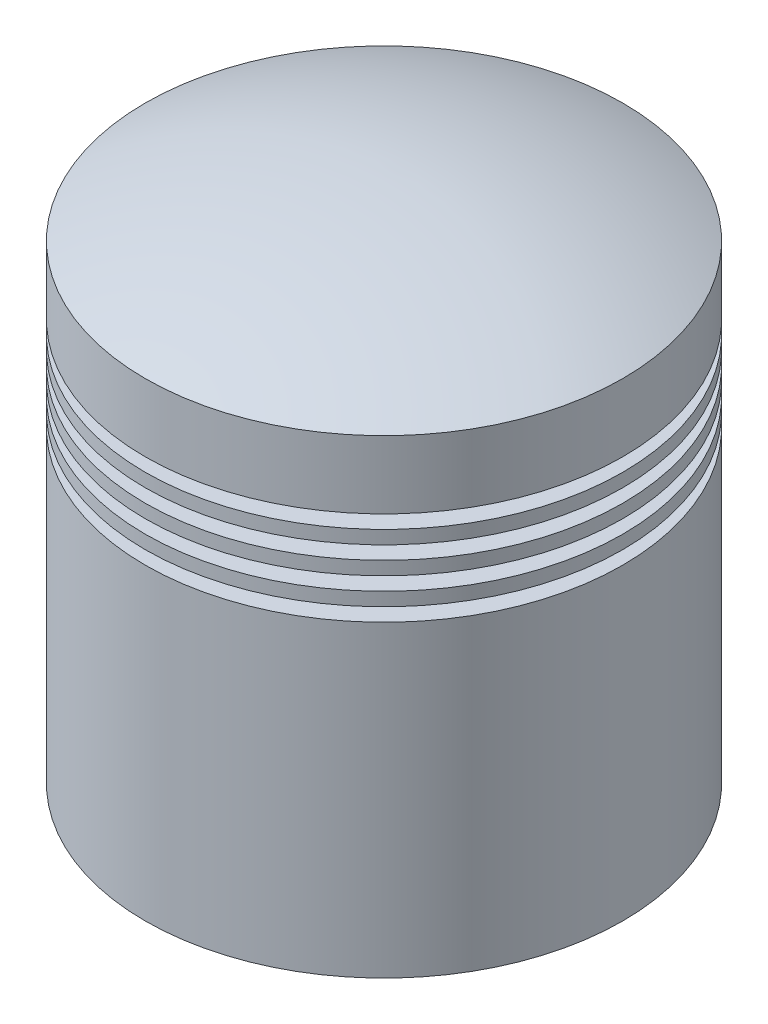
from build123d import *


with BuildPart() as part:
    # Sketch1 (on Front Plane) → Revolve1 (revolve)
    with BuildSketch(Plane.XY, mode=Mode.PRIVATE) as revolve1_sk:
        with BuildLine():
            Line((34.539251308, 89.908336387), (0, 89.908336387))
            Line((0, 89.908336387), (0, 100))
            ThreePointArc((0, 100), (22.834111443, 97.445509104), (44.539251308, 89.908336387))
            Line((44.539251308, 89.908336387), (44.539251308, 77.264054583))
            Line((44.539251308, 77.264054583), (39.539251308, 77.264054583))
            Line((39.539251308, 77.264054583), (39.539251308, 74.764054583))
            Line((39.539251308, 74.764054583), (44.539251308, 74.764054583))
            Line((44.539251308, 74.764054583), (44.539251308, 72.264054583))
            Line((44.539251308, 72.264054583), (39.539251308, 72.264054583))
            Line((39.539251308, 72.264054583), (39.539251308, 69.764054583))
            Line((39.539251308, 69.764054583), (44.539251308, 69.764054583))
            Line((44.539251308, 69.764054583), (44.539251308, 67.264054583))
            Line((44.539251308, 67.264054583), (39.539251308, 67.264054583))
            Line((39.539251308, 67.264054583), (39.539251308, 64.764054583))
            Line((39.539251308, 64.764054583), (44.539251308, 64.764054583))
            Line((44.539251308, 64.764054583), (44.539251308, 62.264054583))
            Line((44.539251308, 62.264054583), (39.539251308, 62.264054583))
            Line((39.539251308, 62.264054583), (39.539251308, 59.764054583))
            Line((39.539251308, 59.764054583), (44.539251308, 59.764054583))
            Line((44.539251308, 59.764054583), (44.539251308, 2.264054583))
            Line((44.539251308, 2.264054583), (39.539251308, 2.264054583))
            Line((39.539251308, 2.264054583), (39.539251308, 47.264054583))
            Line((39.539251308, 47.264054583), (34.539251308, 47.264054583))
            Line((34.539251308, 47.264054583), (34.539251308, 89.908336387))
        make_face()
    revolve(revolve1_sk.sketch.rotate(Axis((0, 0, 0), (0, 1, 0)), 90), axis=Axis((0, 0, 0), (0, 1, 0)))


solid = part.part
